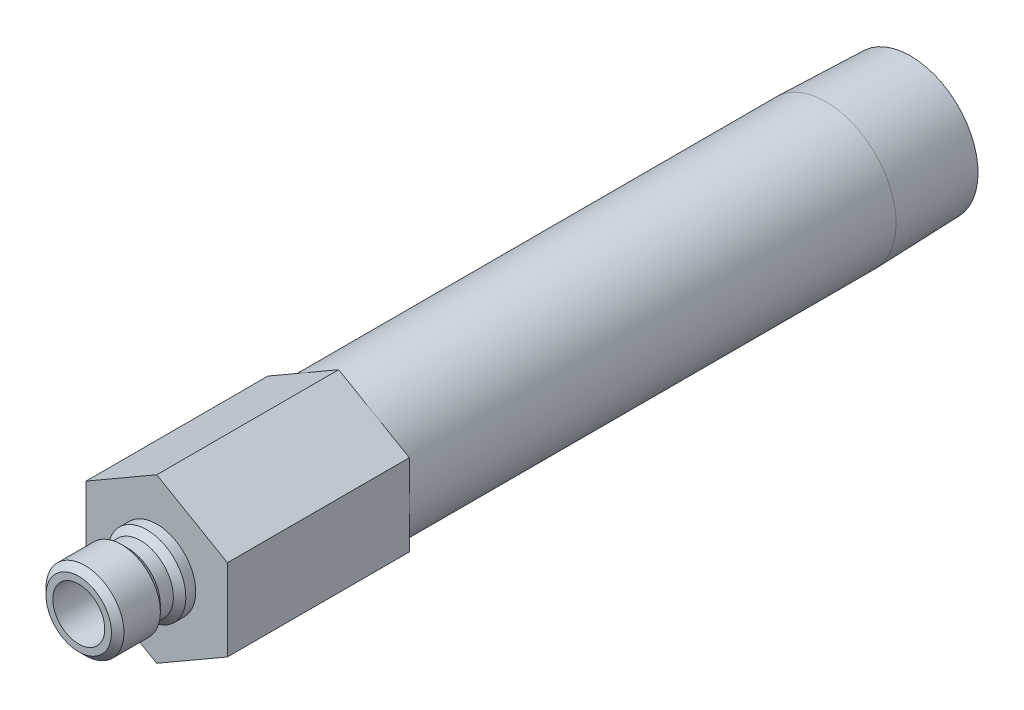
from build123d import *

# Parameters (mm, degrees)
SKETCH2_R           = 3.175
BOSS_EXTRUDE1_DEPTH = 22.225


with BuildPart() as part:
    # Sketch1 → Revolve1 (revolve)
    with BuildSketch(Plane(origin=(0, 0, 0), x_dir=(0, 0, -1), z_dir=(1, 0, 0))):
        Polygon((-9.525, 3.175), (-9.525, 4.0005), (-8.763, 4.7625), (-4.318, 4.7625), (-3.556, 4.0005), (-1.9685, 4.0005), (-1.2065, 4.7625), (0, 4.7625), (0, 8.5725), (81.7372, 8.5725), (92.075, 8.249445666), (92.075, 6.2611), (22.225, 6.2611), (22.225, 3.175), align=None)
    revolve(axis=Axis((0, 0, 0), (0, 0, 1)))

    # Sketch2 → Boss-Extrude1 (add)
    with BuildSketch(Plane.XY):
        Polygon((-8.636, 4.985996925), (-8.636, -4.985996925), (0, -9.971993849), (8.636, -4.985996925), (8.636, 4.985996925), (0, 9.971993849), align=None)
        with Locations(Location((0, 0, 0), (0, 0, 90))):
            Circle(SKETCH2_R, mode=Mode.SUBTRACT)
    extrude(amount=-BOSS_EXTRUDE1_DEPTH)


solid = part.part
